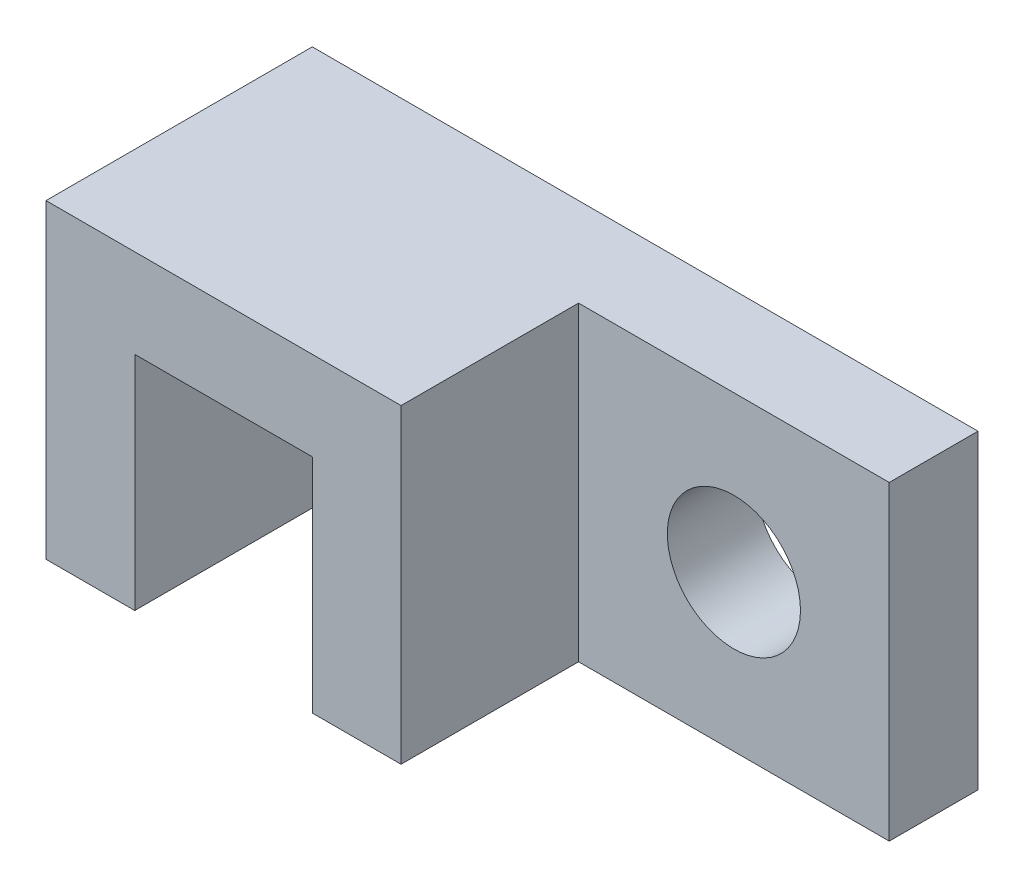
ISO-10303-21;
HEADER;
FILE_DESCRIPTION(('STEP AP214'),'2;1');
FILE_NAME('part.step','',(''),(''),'','','');
FILE_SCHEMA(('AUTOMOTIVE_DESIGN { 1 0 10303 214 1 1 1 1 }'));
ENDSEC;
DATA;
#1=APPLICATION_CONTEXT('core data for automotive mechanical design processes');
#2=APPLICATION_PROTOCOL_DEFINITION('international standard','automotive_design',2000,#1);
#3=PRODUCT_CONTEXT('',#1,'mechanical');
#4=PRODUCT('Part','Part','',(#3));
#5=PRODUCT_RELATED_PRODUCT_CATEGORY('part','',(#4));
#6=PRODUCT_DEFINITION_FORMATION('','',#4);
#7=PRODUCT_DEFINITION_CONTEXT('part definition',#1,'design');
#8=PRODUCT_DEFINITION('design','',#6,#7);
#9=PRODUCT_DEFINITION_SHAPE('','',#8);
#10=(LENGTH_UNIT() NAMED_UNIT(*) SI_UNIT(.MILLI.,.METRE.));
#11=(NAMED_UNIT(*) PLANE_ANGLE_UNIT() SI_UNIT($,.RADIAN.));
#12=(NAMED_UNIT(*) SI_UNIT($,.STERADIAN.) SOLID_ANGLE_UNIT());
#13=UNCERTAINTY_MEASURE_WITH_UNIT(LENGTH_MEASURE(1.E-05),#10,'distance_accuracy_value','');
#14=(GEOMETRIC_REPRESENTATION_CONTEXT(3) GLOBAL_UNCERTAINTY_ASSIGNED_CONTEXT((#13)) GLOBAL_UNIT_ASSIGNED_CONTEXT((#10,
#11,#12)) REPRESENTATION_CONTEXT('',''));
#15=CARTESIAN_POINT('',(0.,0.,0.));
#16=DIRECTION('',(0.,0.,1.));
#17=DIRECTION('',(1.,0.,0.));
#18=AXIS2_PLACEMENT_3D('',#15,#16,#17);
#19=CARTESIAN_POINT('',(10.,-47.0172708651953,30.));
#20=DIRECTION('',(-1.,0.,0.));
#21=DIRECTION('',(0.,0.,1.));
#22=AXIS2_PLACEMENT_3D('',#19,#20,#21);
#23=PLANE('',#22);
#24=DIRECTION('',(0.,1.,0.));
#25=VECTOR('',#24,1.);
#26=CARTESIAN_POINT('',(10.,-47.0172708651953,0.));
#27=LINE('',#26,#25);
#28=CARTESIAN_POINT('',(10.,0.,0.));
#29=VERTEX_POINT('',#28);
#30=CARTESIAN_POINT('',(10.,25.,0.));
#31=VERTEX_POINT('',#30);
#32=EDGE_CURVE('E129',#29,#31,#27,.T.);
#33=ORIENTED_EDGE('',*,*,#32,.T.);
#34=DIRECTION('',(0.,0.,-1.));
#35=VECTOR('',#34,1.);
#36=CARTESIAN_POINT('',(10.,25.,30.));
#37=LINE('',#36,#35);
#38=CARTESIAN_POINT('',(10.,25.,30.));
#39=VERTEX_POINT('',#38);
#40=EDGE_CURVE('E11',#39,#31,#37,.T.);
#41=ORIENTED_EDGE('',*,*,#40,.F.);
#42=DIRECTION('',(0.,1.,0.));
#43=VECTOR('',#42,1.);
#44=CARTESIAN_POINT('',(10.,-47.0172708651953,30.));
#45=LINE('',#44,#43);
#46=CARTESIAN_POINT('',(10.,0.,30.));
#47=VERTEX_POINT('',#46);
#48=EDGE_CURVE('E190',#47,#39,#45,.T.);
#49=ORIENTED_EDGE('',*,*,#48,.F.);
#50=DIRECTION('',(0.,0.,-1.));
#51=VECTOR('',#50,1.);
#52=CARTESIAN_POINT('',(10.,0.,30.));
#53=LINE('',#52,#51);
#54=EDGE_CURVE('E206',#47,#29,#53,.T.);
#55=ORIENTED_EDGE('',*,*,#54,.T.);
#56=EDGE_LOOP('',(#33,#41,#49,#55));
#57=FACE_BOUND('',#56,.T.);
#58=ADVANCED_FACE('F28',(#57),#23,.F.);
#59=CARTESIAN_POINT('',(37.5,25.,30.));
#60=DIRECTION('',(0.,1.,0.));
#61=DIRECTION('',(0.,0.,1.));
#62=AXIS2_PLACEMENT_3D('',#59,#60,#61);
#63=PLANE('',#62);
#64=DIRECTION('',(1.,0.,0.));
#65=VECTOR('',#64,1.);
#66=CARTESIAN_POINT('',(37.5,25.,0.));
#67=LINE('',#66,#65);
#68=CARTESIAN_POINT('',(30.,25.,0.));
#69=VERTEX_POINT('',#68);
#70=EDGE_CURVE('E177',#31,#69,#67,.T.);
#71=ORIENTED_EDGE('',*,*,#70,.T.);
#72=DIRECTION('',(0.,0.,-1.));
#73=VECTOR('',#72,1.);
#74=CARTESIAN_POINT('',(30.,25.,30.));
#75=LINE('',#74,#73);
#76=CARTESIAN_POINT('',(30.,25.,30.));
#77=VERTEX_POINT('',#76);
#78=EDGE_CURVE('E36',#77,#69,#75,.T.);
#79=ORIENTED_EDGE('',*,*,#78,.F.);
#80=DIRECTION('',(1.,0.,0.));
#81=VECTOR('',#80,1.);
#82=CARTESIAN_POINT('',(37.5,25.,30.));
#83=LINE('',#82,#81);
#84=EDGE_CURVE('E192',#39,#77,#83,.T.);
#85=ORIENTED_EDGE('',*,*,#84,.F.);
#86=ORIENTED_EDGE('',*,*,#40,.T.);
#87=EDGE_LOOP('',(#71,#79,#85,#86));
#88=FACE_BOUND('',#87,.T.);
#89=ADVANCED_FACE('F178',(#88),#63,.F.);
#90=CARTESIAN_POINT('',(30.,-47.0172708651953,30.));
#91=DIRECTION('',(-1.,0.,0.));
#92=DIRECTION('',(0.,0.,1.));
#93=AXIS2_PLACEMENT_3D('',#90,#91,#92);
#94=PLANE('',#93);
#95=DIRECTION('',(0.,1.,0.));
#96=VECTOR('',#95,1.);
#97=CARTESIAN_POINT('',(30.,-47.0172708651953,0.));
#98=LINE('',#97,#96);
#99=CARTESIAN_POINT('',(30.,0.,0.));
#100=VERTEX_POINT('',#99);
#101=EDGE_CURVE('E122',#100,#69,#98,.T.);
#102=ORIENTED_EDGE('',*,*,#101,.F.);
#103=DIRECTION('',(0.,0.,-1.));
#104=VECTOR('',#103,1.);
#105=CARTESIAN_POINT('',(30.,0.,30.));
#106=LINE('',#105,#104);
#107=CARTESIAN_POINT('',(30.,0.,30.));
#108=VERTEX_POINT('',#107);
#109=EDGE_CURVE('E116',#108,#100,#106,.T.);
#110=ORIENTED_EDGE('',*,*,#109,.F.);
#111=DIRECTION('',(0.,1.,0.));
#112=VECTOR('',#111,1.);
#113=CARTESIAN_POINT('',(30.,-47.0172708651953,30.));
#114=LINE('',#113,#112);
#115=EDGE_CURVE('E175',#108,#77,#114,.T.);
#116=ORIENTED_EDGE('',*,*,#115,.T.);
#117=ORIENTED_EDGE('',*,*,#78,.T.);
#118=EDGE_LOOP('',(#102,#110,#116,#117));
#119=FACE_BOUND('',#118,.T.);
#120=ADVANCED_FACE('F173',(#119),#94,.T.);
#121=CARTESIAN_POINT('',(37.5,0.,30.));
#122=DIRECTION('',(0.,1.,0.));
#123=DIRECTION('',(0.,0.,1.));
#124=AXIS2_PLACEMENT_3D('',#121,#122,#123);
#125=PLANE('',#124);
#126=DIRECTION('',(1.,0.,0.));
#127=VECTOR('',#126,1.);
#128=CARTESIAN_POINT('',(37.5,0.,0.));
#129=LINE('',#128,#127);
#130=CARTESIAN_POINT('',(75.,0.,0.));
#131=VERTEX_POINT('',#130);
#132=EDGE_CURVE('E110',#100,#131,#129,.T.);
#133=ORIENTED_EDGE('',*,*,#132,.T.);
#134=DIRECTION('',(0.,0.,-1.));
#135=VECTOR('',#134,1.);
#136=CARTESIAN_POINT('',(75.,0.,10.));
#137=LINE('',#136,#135);
#138=CARTESIAN_POINT('',(75.,0.,10.));
#139=VERTEX_POINT('',#138);
#140=EDGE_CURVE('E113',#139,#131,#137,.T.);
#141=ORIENTED_EDGE('',*,*,#140,.F.);
#142=DIRECTION('',(1.,0.,0.));
#143=VECTOR('',#142,1.);
#144=CARTESIAN_POINT('',(37.5,0.,10.));
#145=LINE('',#144,#143);
#146=CARTESIAN_POINT('',(40.,0.,10.));
#147=VERTEX_POINT('',#146);
#148=EDGE_CURVE('E152',#147,#139,#145,.T.);
#149=ORIENTED_EDGE('',*,*,#148,.F.);
#150=DIRECTION('',(0.,0.,-1.));
#151=VECTOR('',#150,1.);
#152=CARTESIAN_POINT('',(40.,0.,30.));
#153=LINE('',#152,#151);
#154=CARTESIAN_POINT('',(40.,0.,30.));
#155=VERTEX_POINT('',#154);
#156=EDGE_CURVE('E158',#155,#147,#153,.T.);
#157=ORIENTED_EDGE('',*,*,#156,.F.);
#158=DIRECTION('',(1.,0.,0.));
#159=VECTOR('',#158,1.);
#160=CARTESIAN_POINT('',(37.5,0.,30.));
#161=LINE('',#160,#159);
#162=EDGE_CURVE('E195',#108,#155,#161,.T.);
#163=ORIENTED_EDGE('',*,*,#162,.F.);
#164=ORIENTED_EDGE('',*,*,#109,.T.);
#165=EDGE_LOOP('',(#133,#141,#149,#157,#163,#164));
#166=FACE_BOUND('',#165,.T.);
#167=ADVANCED_FACE('F112',(#166),#125,.F.);
#168=CARTESIAN_POINT('',(40.,-47.0172708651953,30.));
#169=DIRECTION('',(-1.,0.,0.));
#170=DIRECTION('',(0.,0.,1.));
#171=AXIS2_PLACEMENT_3D('',#168,#169,#170);
#172=PLANE('',#171);
#173=ORIENTED_EDGE('',*,*,#156,.T.);
#174=DIRECTION('',(0.,1.,0.));
#175=VECTOR('',#174,1.);
#176=CARTESIAN_POINT('',(40.,-47.0172708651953,10.));
#177=LINE('',#176,#175);
#178=CARTESIAN_POINT('',(40.,35.,9.99999999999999));
#179=VERTEX_POINT('',#178);
#180=EDGE_CURVE('E142',#147,#179,#177,.T.);
#181=ORIENTED_EDGE('',*,*,#180,.T.);
#182=DIRECTION('',(0.,0.,-1.));
#183=VECTOR('',#182,1.);
#184=CARTESIAN_POINT('',(40.,35.,30.));
#185=LINE('',#184,#183);
#186=CARTESIAN_POINT('',(40.,35.,30.));
#187=VERTEX_POINT('',#186);
#188=EDGE_CURVE('E162',#187,#179,#185,.T.);
#189=ORIENTED_EDGE('',*,*,#188,.F.);
#190=DIRECTION('',(0.,1.,0.));
#191=VECTOR('',#190,1.);
#192=CARTESIAN_POINT('',(40.,-47.0172708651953,30.));
#193=LINE('',#192,#191);
#194=EDGE_CURVE('E197',#155,#187,#193,.T.);
#195=ORIENTED_EDGE('',*,*,#194,.F.);
#196=EDGE_LOOP('',(#173,#181,#189,#195));
#197=FACE_BOUND('',#196,.T.);
#198=ADVANCED_FACE('F218',(#197),#172,.F.);
#199=CARTESIAN_POINT('',(37.5,35.,30.));
#200=DIRECTION('',(0.,1.,0.));
#201=DIRECTION('',(0.,0.,1.));
#202=AXIS2_PLACEMENT_3D('',#199,#200,#201);
#203=PLANE('',#202);
#204=DIRECTION('',(1.,0.,0.));
#205=VECTOR('',#204,1.);
#206=CARTESIAN_POINT('',(37.5,35.,0.));
#207=LINE('',#206,#205);
#208=CARTESIAN_POINT('',(0.,35.,0.));
#209=VERTEX_POINT('',#208);
#210=CARTESIAN_POINT('',(75.,35.,0.));
#211=VERTEX_POINT('',#210);
#212=EDGE_CURVE('E121',#209,#211,#207,.T.);
#213=ORIENTED_EDGE('',*,*,#212,.F.);
#214=DIRECTION('',(0.,0.,-1.));
#215=VECTOR('',#214,1.);
#216=CARTESIAN_POINT('',(0.,35.,30.));
#217=LINE('',#216,#215);
#218=CARTESIAN_POINT('',(0.,35.,30.));
#219=VERTEX_POINT('',#218);
#220=EDGE_CURVE('E210',#219,#209,#217,.T.);
#221=ORIENTED_EDGE('',*,*,#220,.F.);
#222=DIRECTION('',(1.,0.,0.));
#223=VECTOR('',#222,1.);
#224=CARTESIAN_POINT('',(37.5,35.,30.));
#225=LINE('',#224,#223);
#226=EDGE_CURVE('E199',#219,#187,#225,.T.);
#227=ORIENTED_EDGE('',*,*,#226,.T.);
#228=ORIENTED_EDGE('',*,*,#188,.T.);
#229=DIRECTION('',(1.,0.,0.));
#230=VECTOR('',#229,1.);
#231=CARTESIAN_POINT('',(37.5,35.,10.));
#232=LINE('',#231,#230);
#233=CARTESIAN_POINT('',(75.,35.,10.));
#234=VERTEX_POINT('',#233);
#235=EDGE_CURVE('E44',#179,#234,#232,.T.);
#236=ORIENTED_EDGE('',*,*,#235,.T.);
#237=DIRECTION('',(0.,0.,-1.));
#238=VECTOR('',#237,1.);
#239=CARTESIAN_POINT('',(75.,35.,10.));
#240=LINE('',#239,#238);
#241=EDGE_CURVE('E130',#234,#211,#240,.T.);
#242=ORIENTED_EDGE('',*,*,#241,.T.);
#243=EDGE_LOOP('',(#213,#221,#227,#228,#236,#242));
#244=FACE_BOUND('',#243,.T.);
#245=ADVANCED_FACE('F214',(#244),#203,.T.);
#246=CARTESIAN_POINT('',(0.,-47.0172708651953,30.));
#247=DIRECTION('',(-1.,0.,0.));
#248=DIRECTION('',(0.,0.,1.));
#249=AXIS2_PLACEMENT_3D('',#246,#247,#248);
#250=PLANE('',#249);
#251=DIRECTION('',(0.,1.,0.));
#252=VECTOR('',#251,1.);
#253=CARTESIAN_POINT('',(0.,-47.0172708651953,0.));
#254=LINE('',#253,#252);
#255=CARTESIAN_POINT('',(0.,0.,0.));
#256=VERTEX_POINT('',#255);
#257=EDGE_CURVE('E186',#256,#209,#254,.T.);
#258=ORIENTED_EDGE('',*,*,#257,.F.);
#259=DIRECTION('',(0.,0.,-1.));
#260=VECTOR('',#259,1.);
#261=CARTESIAN_POINT('',(0.,0.,30.));
#262=LINE('',#261,#260);
#263=CARTESIAN_POINT('',(0.,0.,30.));
#264=VERTEX_POINT('',#263);
#265=EDGE_CURVE('E209',#264,#256,#262,.T.);
#266=ORIENTED_EDGE('',*,*,#265,.F.);
#267=DIRECTION('',(0.,1.,0.));
#268=VECTOR('',#267,1.);
#269=CARTESIAN_POINT('',(0.,-47.0172708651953,30.));
#270=LINE('',#269,#268);
#271=EDGE_CURVE('E202',#264,#219,#270,.T.);
#272=ORIENTED_EDGE('',*,*,#271,.T.);
#273=ORIENTED_EDGE('',*,*,#220,.T.);
#274=EDGE_LOOP('',(#258,#266,#272,#273));
#275=FACE_BOUND('',#274,.T.);
#276=ADVANCED_FACE('F240',(#275),#250,.T.);
#277=CARTESIAN_POINT('',(37.5,0.,30.));
#278=DIRECTION('',(0.,1.,0.));
#279=DIRECTION('',(0.,0.,1.));
#280=AXIS2_PLACEMENT_3D('',#277,#278,#279);
#281=PLANE('',#280);
#282=DIRECTION('',(1.,0.,0.));
#283=VECTOR('',#282,1.);
#284=CARTESIAN_POINT('',(37.5,0.,0.));
#285=LINE('',#284,#283);
#286=EDGE_CURVE('E188',#256,#29,#285,.T.);
#287=ORIENTED_EDGE('',*,*,#286,.T.);
#288=ORIENTED_EDGE('',*,*,#54,.F.);
#289=DIRECTION('',(1.,0.,0.));
#290=VECTOR('',#289,1.);
#291=CARTESIAN_POINT('',(37.5,0.,30.));
#292=LINE('',#291,#290);
#293=EDGE_CURVE('E52',#264,#47,#292,.T.);
#294=ORIENTED_EDGE('',*,*,#293,.F.);
#295=ORIENTED_EDGE('',*,*,#265,.T.);
#296=EDGE_LOOP('',(#287,#288,#294,#295));
#297=FACE_BOUND('',#296,.T.);
#298=ADVANCED_FACE('F241',(#297),#281,.F.);
#299=CARTESIAN_POINT('',(37.5,-47.0172708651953,30.));
#300=DIRECTION('',(0.,0.,1.));
#301=DIRECTION('',(1.,0.,0.));
#302=AXIS2_PLACEMENT_3D('',#299,#300,#301);
#303=PLANE('',#302);
#304=ORIENTED_EDGE('',*,*,#48,.T.);
#305=ORIENTED_EDGE('',*,*,#84,.T.);
#306=ORIENTED_EDGE('',*,*,#115,.F.);
#307=ORIENTED_EDGE('',*,*,#162,.T.);
#308=ORIENTED_EDGE('',*,*,#194,.T.);
#309=ORIENTED_EDGE('',*,*,#226,.F.);
#310=ORIENTED_EDGE('',*,*,#271,.F.);
#311=ORIENTED_EDGE('',*,*,#293,.T.);
#312=EDGE_LOOP('',(#304,#305,#306,#307,#308,#309,#310,#311));
#313=FACE_BOUND('',#312,.T.);
#314=ADVANCED_FACE('F242',(#313),#303,.T.);
#315=CARTESIAN_POINT('',(37.5,-47.0172708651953,0.));
#316=DIRECTION('',(0.,0.,1.));
#317=DIRECTION('',(1.,0.,0.));
#318=AXIS2_PLACEMENT_3D('',#315,#316,#317);
#319=PLANE('',#318);
#320=ORIENTED_EDGE('',*,*,#32,.F.);
#321=ORIENTED_EDGE('',*,*,#286,.F.);
#322=ORIENTED_EDGE('',*,*,#257,.T.);
#323=ORIENTED_EDGE('',*,*,#212,.T.);
#324=DIRECTION('',(0.,-1.,0.));
#325=VECTOR('',#324,1.);
#326=CARTESIAN_POINT('',(75.,-47.0172708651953,0.));
#327=LINE('',#326,#325);
#328=EDGE_CURVE('E127',#211,#131,#327,.T.);
#329=ORIENTED_EDGE('',*,*,#328,.T.);
#330=ORIENTED_EDGE('',*,*,#132,.F.);
#331=ORIENTED_EDGE('',*,*,#101,.T.);
#332=ORIENTED_EDGE('',*,*,#70,.F.);
#333=EDGE_LOOP('',(#320,#321,#322,#323,#329,#330,#331,#332));
#334=FACE_BOUND('',#333,.T.);
#335=CARTESIAN_POINT('',(57.5,17.5,0.));
#336=DIRECTION('',(0.,0.,1.));
#337=DIRECTION('',(1.,0.,0.));
#338=AXIS2_PLACEMENT_3D('',#335,#336,#337);
#339=CIRCLE('',#338,7.5);
#340=CARTESIAN_POINT('',(65.,17.5,0.));
#341=VERTEX_POINT('',#340);
#342=EDGE_CURVE('E139',#341,#341,#339,.T.);
#343=ORIENTED_EDGE('',*,*,#342,.T.);
#344=EDGE_LOOP('',(#343));
#345=FACE_BOUND('',#344,.T.);
#346=ADVANCED_FACE('F133',(#334,#345),#319,.F.);
#347=CARTESIAN_POINT('',(75.,-47.0172708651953,10.));
#348=DIRECTION('',(1.,0.,0.));
#349=DIRECTION('',(0.,0.,-1.));
#350=AXIS2_PLACEMENT_3D('',#347,#348,#349);
#351=PLANE('',#350);
#352=ORIENTED_EDGE('',*,*,#328,.F.);
#353=ORIENTED_EDGE('',*,*,#241,.F.);
#354=DIRECTION('',(0.,-1.,0.));
#355=VECTOR('',#354,1.);
#356=CARTESIAN_POINT('',(75.,-47.0172708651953,10.));
#357=LINE('',#356,#355);
#358=EDGE_CURVE('E128',#234,#139,#357,.T.);
#359=ORIENTED_EDGE('',*,*,#358,.T.);
#360=ORIENTED_EDGE('',*,*,#140,.T.);
#361=EDGE_LOOP('',(#352,#353,#359,#360));
#362=FACE_BOUND('',#361,.T.);
#363=ADVANCED_FACE('F126',(#362),#351,.T.);
#364=CARTESIAN_POINT('',(57.5,17.5,10.));
#365=DIRECTION('',(0.,0.,-1.));
#366=DIRECTION('',(-1.,0.,0.));
#367=AXIS2_PLACEMENT_3D('',#364,#365,#366);
#368=CYLINDRICAL_SURFACE('',#367,7.5);
#369=CARTESIAN_POINT('',(57.5,17.5,10.));
#370=DIRECTION('',(0.,0.,1.));
#371=DIRECTION('',(1.,0.,0.));
#372=AXIS2_PLACEMENT_3D('',#369,#370,#371);
#373=CIRCLE('',#372,7.5);
#374=CARTESIAN_POINT('',(65.,17.5,10.));
#375=VERTEX_POINT('',#374);
#376=EDGE_CURVE('E138',#375,#375,#373,.T.);
#377=ORIENTED_EDGE('',*,*,#376,.T.);
#378=EDGE_LOOP('',(#377));
#379=FACE_BOUND('',#378,.T.);
#380=ORIENTED_EDGE('',*,*,#342,.F.);
#381=EDGE_LOOP('',(#380));
#382=FACE_BOUND('',#381,.T.);
#383=ADVANCED_FACE('F222',(#379,#382),#368,.F.);
#384=CARTESIAN_POINT('',(37.5,-47.0172708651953,10.));
#385=DIRECTION('',(0.,0.,1.));
#386=DIRECTION('',(1.,0.,0.));
#387=AXIS2_PLACEMENT_3D('',#384,#385,#386);
#388=PLANE('',#387);
#389=ORIENTED_EDGE('',*,*,#376,.F.);
#390=EDGE_LOOP('',(#389));
#391=FACE_BOUND('',#390,.T.);
#392=ORIENTED_EDGE('',*,*,#180,.F.);
#393=ORIENTED_EDGE('',*,*,#148,.T.);
#394=ORIENTED_EDGE('',*,*,#358,.F.);
#395=ORIENTED_EDGE('',*,*,#235,.F.);
#396=EDGE_LOOP('',(#392,#393,#394,#395));
#397=FACE_BOUND('',#396,.T.);
#398=ADVANCED_FACE('F220',(#391,#397),#388,.T.);
#399=CLOSED_SHELL('',(#58,#89,#120,#167,#198,#245,#276,#298,#314,#346,#363,#383,#398));
#400=MANIFOLD_SOLID_BREP('B2',#399);
#401=ADVANCED_BREP_SHAPE_REPRESENTATION('',(#18,#400),#14);
#402=SHAPE_DEFINITION_REPRESENTATION(#9,#401);
ENDSEC;
END-ISO-10303-21;
